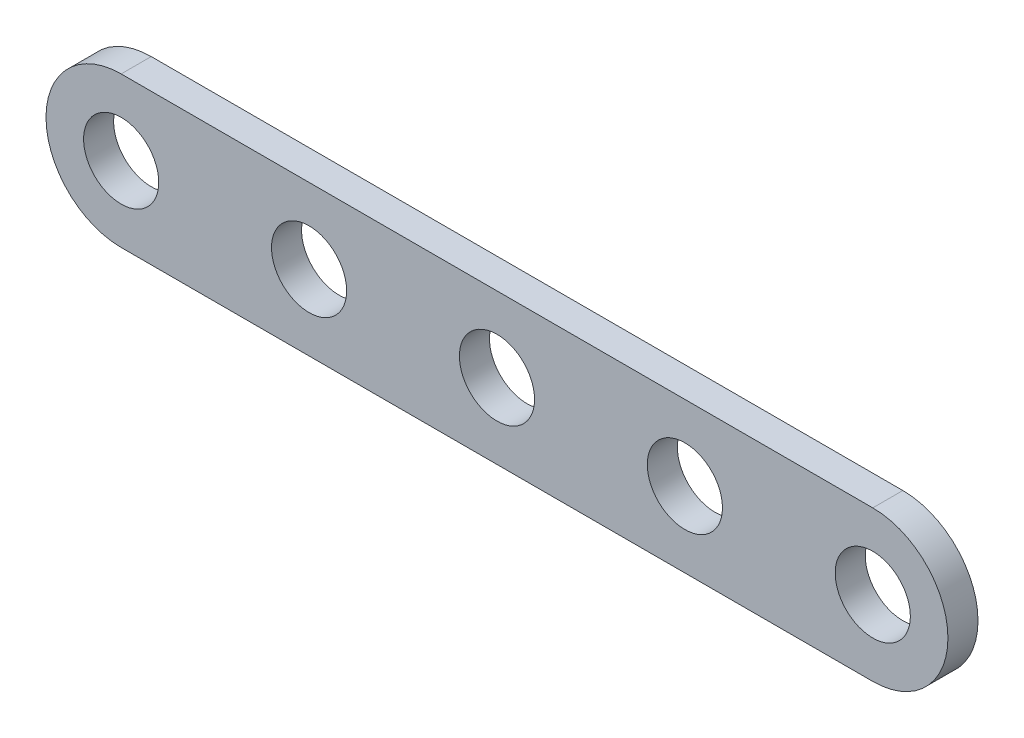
from build123d import *

# Parameters (mm, degrees)
BASE_EXTRUDE_DEPTH = 10
SKETCH2_R          = 25
CUT_EXTRUDE1_DEPTH = 560.374650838
LPATTERN1_COUNT    = 5
LPATTERN1_PITCH    = 125


with BuildPart() as part:
    # Sketch1 → Base-Extrude (new, symmetric)
    with BuildSketch(Plane.XY):
        with BuildLine():
            Line((0, 0), (500, 0))
            ThreePointArc((500, 0), (550, 50), (500, 100))
            Line((500, 100), (0, 100))
            ThreePointArc((0, 100), (-50, 50), (0, 0))
        make_face()
    extrude(amount=BASE_EXTRUDE_DEPTH, both=True)

    # Sketch2 → Cut-Extrude1 (cut, through all)
    with BuildSketch(Plane.XY.offset(10)):
        with Locations((0, 50)):
            Circle(SKETCH2_R)
    cut_extrude1 = extrude(amount=-CUT_EXTRUDE1_DEPTH, mode=Mode.SUBTRACT)

    # LPattern1: Cut-Extrude1 ×5
    with Locations(*[(i * LPATTERN1_PITCH, 0, 0) for i in range(1, LPATTERN1_COUNT)]):
        add(cut_extrude1, mode=Mode.SUBTRACT)


solid = part.part
